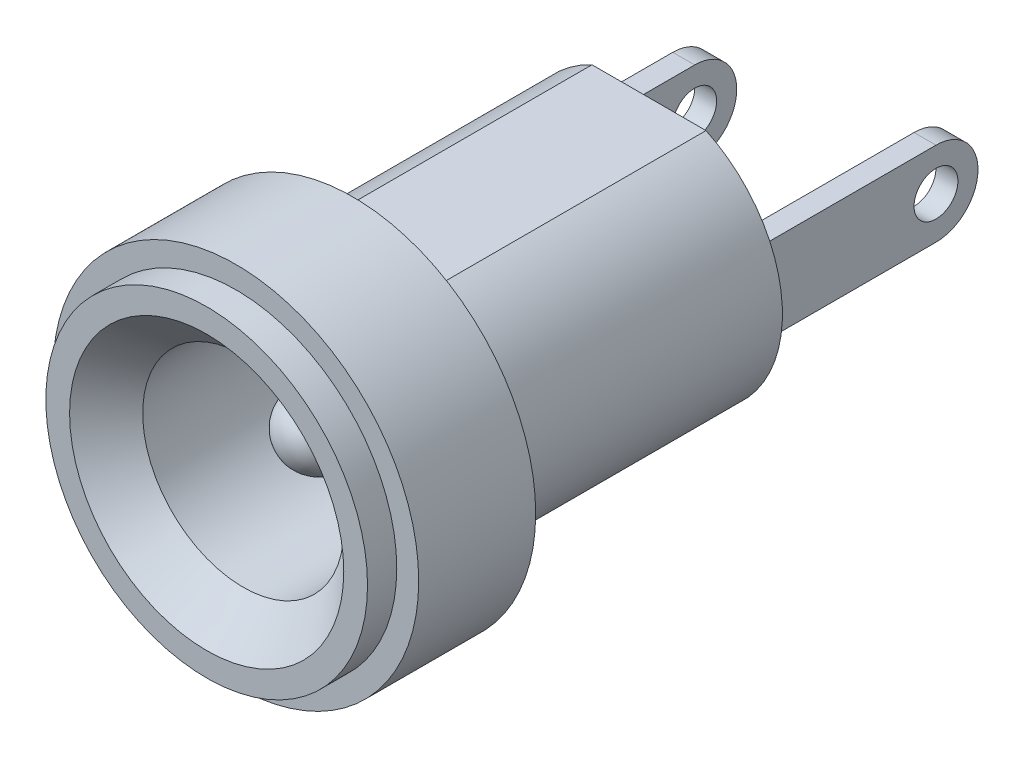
ISO-10303-21;
HEADER;
FILE_DESCRIPTION(('STEP AP214'),'2;1');
FILE_NAME('part.step','',(''),(''),'','','');
FILE_SCHEMA(('AUTOMOTIVE_DESIGN { 1 0 10303 214 1 1 1 1 }'));
ENDSEC;
DATA;
#1=APPLICATION_CONTEXT('core data for automotive mechanical design processes');
#2=APPLICATION_PROTOCOL_DEFINITION('international standard','automotive_design',2000,#1);
#3=PRODUCT_CONTEXT('',#1,'mechanical');
#4=PRODUCT('Part','Part','',(#3));
#5=PRODUCT_RELATED_PRODUCT_CATEGORY('part','',(#4));
#6=PRODUCT_DEFINITION_FORMATION('','',#4);
#7=PRODUCT_DEFINITION_CONTEXT('part definition',#1,'design');
#8=PRODUCT_DEFINITION('design','',#6,#7);
#9=PRODUCT_DEFINITION_SHAPE('','',#8);
#10=(LENGTH_UNIT() NAMED_UNIT(*) SI_UNIT(.MILLI.,.METRE.));
#11=(NAMED_UNIT(*) PLANE_ANGLE_UNIT() SI_UNIT($,.RADIAN.));
#12=(NAMED_UNIT(*) SI_UNIT($,.STERADIAN.) SOLID_ANGLE_UNIT());
#13=UNCERTAINTY_MEASURE_WITH_UNIT(LENGTH_MEASURE(1.E-05),#10,'distance_accuracy_value','');
#14=(GEOMETRIC_REPRESENTATION_CONTEXT(3) GLOBAL_UNCERTAINTY_ASSIGNED_CONTEXT((#13)) GLOBAL_UNIT_ASSIGNED_CONTEXT((#10,
#11,#12)) REPRESENTATION_CONTEXT('',''));
#15=CARTESIAN_POINT('',(0.,0.,0.));
#16=DIRECTION('',(0.,0.,1.));
#17=DIRECTION('',(1.,0.,0.));
#18=AXIS2_PLACEMENT_3D('',#15,#16,#17);
#19=CARTESIAN_POINT('',(0.,0.,-8.1));
#20=DIRECTION('',(0.,0.,1.));
#21=DIRECTION('',(1.,0.,0.));
#22=AXIS2_PLACEMENT_3D('',#19,#20,#21);
#23=PLANE('',#22);
#24=DIRECTION('',(1.,0.,0.));
#25=VECTOR('',#24,1.);
#26=CARTESIAN_POINT('',(2.3,1.15,-8.1));
#27=LINE('',#26,#25);
#28=CARTESIAN_POINT('',(2.3,1.15,-8.1));
#29=VERTEX_POINT('',#28);
#30=CARTESIAN_POINT('',(2.9,1.15,-8.1));
#31=VERTEX_POINT('',#30);
#32=EDGE_CURVE('E153',#29,#31,#27,.T.);
#33=ORIENTED_EDGE('',*,*,#32,.F.);
#34=DIRECTION('',(0.,-1.,0.));
#35=VECTOR('',#34,1.);
#36=CARTESIAN_POINT('',(2.3,1.15,-8.1));
#37=LINE('',#36,#35);
#38=CARTESIAN_POINT('',(2.3,-1.15,-8.1));
#39=VERTEX_POINT('',#38);
#40=EDGE_CURVE('E186',#29,#39,#37,.T.);
#41=ORIENTED_EDGE('',*,*,#40,.T.);
#42=DIRECTION('',(1.,0.,0.));
#43=VECTOR('',#42,1.);
#44=CARTESIAN_POINT('',(2.3,-1.15,-8.1));
#45=LINE('',#44,#43);
#46=CARTESIAN_POINT('',(2.9,-1.15,-8.1));
#47=VERTEX_POINT('',#46);
#48=EDGE_CURVE('E183',#39,#47,#45,.T.);
#49=ORIENTED_EDGE('',*,*,#48,.T.);
#50=DIRECTION('',(0.,-1.,0.));
#51=VECTOR('',#50,1.);
#52=CARTESIAN_POINT('',(2.9,1.15,-8.1));
#53=LINE('',#52,#51);
#54=EDGE_CURVE('E180',#31,#47,#53,.T.);
#55=ORIENTED_EDGE('',*,*,#54,.F.);
#56=EDGE_LOOP('',(#33,#41,#49,#55));
#57=FACE_BOUND('',#56,.T.);
#58=DIRECTION('',(1.,0.,0.));
#59=VECTOR('',#58,1.);
#60=CARTESIAN_POINT('',(-1.55964739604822,3.3,-8.1));
#61=LINE('',#60,#59);
#62=CARTESIAN_POINT('',(-1.55964739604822,3.3,-8.1));
#63=VERTEX_POINT('',#62);
#64=CARTESIAN_POINT('',(1.55964739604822,3.3,-8.1));
#65=VERTEX_POINT('',#64);
#66=EDGE_CURVE('E204',#63,#65,#61,.T.);
#67=ORIENTED_EDGE('',*,*,#66,.T.);
#68=CARTESIAN_POINT('',(0.,0.,-8.1));
#69=DIRECTION('',(0.,0.,1.));
#70=DIRECTION('',(1.,0.,0.));
#71=AXIS2_PLACEMENT_3D('',#68,#69,#70);
#72=CIRCLE('',#71,3.65);
#73=CARTESIAN_POINT('',(1.55964739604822,-3.3,-8.1));
#74=VERTEX_POINT('',#73);
#75=EDGE_CURVE('E206',#74,#65,#72,.T.);
#76=ORIENTED_EDGE('',*,*,#75,.F.);
#77=DIRECTION('',(-1.,0.,0.));
#78=VECTOR('',#77,1.);
#79=CARTESIAN_POINT('',(1.55964739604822,-3.3,-8.1));
#80=LINE('',#79,#78);
#81=CARTESIAN_POINT('',(-1.55964739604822,-3.3,-8.1));
#82=VERTEX_POINT('',#81);
#83=EDGE_CURVE('E210',#74,#82,#80,.T.);
#84=ORIENTED_EDGE('',*,*,#83,.T.);
#85=CARTESIAN_POINT('',(0.,0.,-8.1));
#86=DIRECTION('',(0.,0.,1.));
#87=DIRECTION('',(1.,0.,0.));
#88=AXIS2_PLACEMENT_3D('',#85,#86,#87);
#89=CIRCLE('',#88,3.65);
#90=EDGE_CURVE('E212',#63,#82,#89,.T.);
#91=ORIENTED_EDGE('',*,*,#90,.F.);
#92=EDGE_LOOP('',(#67,#76,#84,#91));
#93=FACE_BOUND('',#92,.T.);
#94=DIRECTION('',(0.,-1.,0.));
#95=VECTOR('',#94,1.);
#96=CARTESIAN_POINT('',(-2.3,1.15,-8.1));
#97=LINE('',#96,#95);
#98=CARTESIAN_POINT('',(-2.3,1.15,-8.1));
#99=VERTEX_POINT('',#98);
#100=CARTESIAN_POINT('',(-2.3,-1.15,-8.1));
#101=VERTEX_POINT('',#100);
#102=EDGE_CURVE('E157',#99,#101,#97,.T.);
#103=ORIENTED_EDGE('',*,*,#102,.F.);
#104=DIRECTION('',(-1.,0.,0.));
#105=VECTOR('',#104,1.);
#106=CARTESIAN_POINT('',(-2.3,1.15,-8.1));
#107=LINE('',#106,#105);
#108=CARTESIAN_POINT('',(-2.9,1.15,-8.1));
#109=VERTEX_POINT('',#108);
#110=EDGE_CURVE('E169',#99,#109,#107,.T.);
#111=ORIENTED_EDGE('',*,*,#110,.T.);
#112=DIRECTION('',(0.,-1.,0.));
#113=VECTOR('',#112,1.);
#114=CARTESIAN_POINT('',(-2.9,1.15,-8.1));
#115=LINE('',#114,#113);
#116=CARTESIAN_POINT('',(-2.9,-1.15,-8.1));
#117=VERTEX_POINT('',#116);
#118=EDGE_CURVE('E167',#109,#117,#115,.T.);
#119=ORIENTED_EDGE('',*,*,#118,.T.);
#120=DIRECTION('',(-1.,0.,0.));
#121=VECTOR('',#120,1.);
#122=CARTESIAN_POINT('',(-2.3,-1.15,-8.1));
#123=LINE('',#122,#121);
#124=EDGE_CURVE('E148',#101,#117,#123,.T.);
#125=ORIENTED_EDGE('',*,*,#124,.F.);
#126=EDGE_LOOP('',(#103,#111,#119,#125));
#127=FACE_BOUND('',#126,.T.);
#128=ADVANCED_FACE('F40',(#57,#93,#127),#23,.F.);
#129=CARTESIAN_POINT('',(0.,0.,0.));
#130=DIRECTION('',(0.,0.,1.));
#131=DIRECTION('',(1.,0.,0.));
#132=AXIS2_PLACEMENT_3D('',#129,#130,#131);
#133=PLANE('',#132);
#134=CARTESIAN_POINT('',(0.,0.,0.));
#135=DIRECTION('',(0.,0.,1.));
#136=DIRECTION('',(1.,0.,0.));
#137=AXIS2_PLACEMENT_3D('',#134,#135,#136);
#138=CIRCLE('',#137,5.);
#139=CARTESIAN_POINT('',(5.,0.,0.));
#140=VERTEX_POINT('',#139);
#141=EDGE_CURVE('E236',#140,#140,#138,.T.);
#142=ORIENTED_EDGE('',*,*,#141,.F.);
#143=EDGE_LOOP('',(#142));
#144=FACE_BOUND('',#143,.T.);
#145=DIRECTION('',(1.,0.,0.));
#146=VECTOR('',#145,1.);
#147=CARTESIAN_POINT('',(-1.55964739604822,3.3,0.));
#148=LINE('',#147,#146);
#149=CARTESIAN_POINT('',(-1.55964739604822,3.3,0.));
#150=VERTEX_POINT('',#149);
#151=CARTESIAN_POINT('',(1.55964739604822,3.3,0.));
#152=VERTEX_POINT('',#151);
#153=EDGE_CURVE('E203',#150,#152,#148,.T.);
#154=ORIENTED_EDGE('',*,*,#153,.F.);
#155=CARTESIAN_POINT('',(0.,0.,0.));
#156=DIRECTION('',(0.,0.,1.));
#157=DIRECTION('',(1.,0.,0.));
#158=AXIS2_PLACEMENT_3D('',#155,#156,#157);
#159=CIRCLE('',#158,3.65);
#160=CARTESIAN_POINT('',(-1.55964739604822,-3.3,0.));
#161=VERTEX_POINT('',#160);
#162=EDGE_CURVE('E207',#150,#161,#159,.T.);
#163=ORIENTED_EDGE('',*,*,#162,.T.);
#164=DIRECTION('',(-1.,0.,0.));
#165=VECTOR('',#164,1.);
#166=CARTESIAN_POINT('',(1.55964739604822,-3.3,0.));
#167=LINE('',#166,#165);
#168=CARTESIAN_POINT('',(1.55964739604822,-3.3,0.));
#169=VERTEX_POINT('',#168);
#170=EDGE_CURVE('E220',#169,#161,#167,.T.);
#171=ORIENTED_EDGE('',*,*,#170,.F.);
#172=CARTESIAN_POINT('',(0.,0.,0.));
#173=DIRECTION('',(0.,0.,1.));
#174=DIRECTION('',(1.,0.,0.));
#175=AXIS2_PLACEMENT_3D('',#172,#173,#174);
#176=CIRCLE('',#175,3.65);
#177=EDGE_CURVE('E217',#169,#152,#176,.T.);
#178=ORIENTED_EDGE('',*,*,#177,.T.);
#179=EDGE_LOOP('',(#154,#163,#171,#178));
#180=FACE_BOUND('',#179,.T.);
#181=ADVANCED_FACE('F319',(#144,#180),#133,.F.);
#182=CARTESIAN_POINT('',(0.,0.,3.2));
#183=DIRECTION('',(0.,0.,-1.));
#184=DIRECTION('',(-1.,0.,0.));
#185=AXIS2_PLACEMENT_3D('',#182,#183,#184);
#186=CYLINDRICAL_SURFACE('',#185,5.);
#187=CARTESIAN_POINT('',(0.,0.,3.2));
#188=DIRECTION('',(0.,0.,1.));
#189=DIRECTION('',(1.,0.,0.));
#190=AXIS2_PLACEMENT_3D('',#187,#188,#189);
#191=CIRCLE('',#190,5.);
#192=CARTESIAN_POINT('',(5.,0.,3.2));
#193=VERTEX_POINT('',#192);
#194=EDGE_CURVE('E241',#193,#193,#191,.T.);
#195=ORIENTED_EDGE('',*,*,#194,.F.);
#196=EDGE_LOOP('',(#195));
#197=FACE_BOUND('',#196,.T.);
#198=ORIENTED_EDGE('',*,*,#141,.T.);
#199=EDGE_LOOP('',(#198));
#200=FACE_BOUND('',#199,.T.);
#201=ADVANCED_FACE('F325',(#197,#200),#186,.T.);
#202=CARTESIAN_POINT('',(0.,0.,3.2));
#203=DIRECTION('',(0.,0.,1.));
#204=DIRECTION('',(1.,0.,0.));
#205=AXIS2_PLACEMENT_3D('',#202,#203,#204);
#206=PLANE('',#205);
#207=CARTESIAN_POINT('',(0.,0.,3.2));
#208=DIRECTION('',(0.,0.,1.));
#209=DIRECTION('',(1.,0.,0.));
#210=AXIS2_PLACEMENT_3D('',#207,#208,#209);
#211=CIRCLE('',#210,4.4);
#212=CARTESIAN_POINT('',(4.4,0.,3.2));
#213=VERTEX_POINT('',#212);
#214=EDGE_CURVE('E237',#213,#213,#211,.T.);
#215=ORIENTED_EDGE('',*,*,#214,.F.);
#216=EDGE_LOOP('',(#215));
#217=FACE_BOUND('',#216,.T.);
#218=ORIENTED_EDGE('',*,*,#194,.T.);
#219=EDGE_LOOP('',(#218));
#220=FACE_BOUND('',#219,.T.);
#221=ADVANCED_FACE('F357',(#217,#220),#206,.T.);
#222=CARTESIAN_POINT('',(0.,0.,4.));
#223=DIRECTION('',(0.,0.,-1.));
#224=DIRECTION('',(-1.,0.,0.));
#225=AXIS2_PLACEMENT_3D('',#222,#223,#224);
#226=CYLINDRICAL_SURFACE('',#225,4.4);
#227=CARTESIAN_POINT('',(0.,0.,4.));
#228=DIRECTION('',(0.,0.,1.));
#229=DIRECTION('',(1.,0.,0.));
#230=AXIS2_PLACEMENT_3D('',#227,#228,#229);
#231=CIRCLE('',#230,4.4);
#232=CARTESIAN_POINT('',(4.4,0.,4.));
#233=VERTEX_POINT('',#232);
#234=EDGE_CURVE('E233',#233,#233,#231,.T.);
#235=ORIENTED_EDGE('',*,*,#234,.F.);
#236=EDGE_LOOP('',(#235));
#237=FACE_BOUND('',#236,.T.);
#238=ORIENTED_EDGE('',*,*,#214,.T.);
#239=EDGE_LOOP('',(#238));
#240=FACE_BOUND('',#239,.T.);
#241=ADVANCED_FACE('F353',(#237,#240),#226,.T.);
#242=CARTESIAN_POINT('',(0.,0.,4.));
#243=DIRECTION('',(0.,0.,1.));
#244=DIRECTION('',(1.,0.,0.));
#245=AXIS2_PLACEMENT_3D('',#242,#243,#244);
#246=PLANE('',#245);
#247=CARTESIAN_POINT('',(0.,0.,4.));
#248=DIRECTION('',(0.,0.,1.));
#249=DIRECTION('',(1.,0.,0.));
#250=AXIS2_PLACEMENT_3D('',#247,#248,#249);
#251=CIRCLE('',#250,3.75);
#252=CARTESIAN_POINT('',(3.75,0.,4.));
#253=VERTEX_POINT('',#252);
#254=EDGE_CURVE('E248',#253,#253,#251,.F.);
#255=ORIENTED_EDGE('',*,*,#254,.T.);
#256=EDGE_LOOP('',(#255));
#257=FACE_BOUND('',#256,.T.);
#258=ORIENTED_EDGE('',*,*,#234,.T.);
#259=EDGE_LOOP('',(#258));
#260=FACE_BOUND('',#259,.T.);
#261=ADVANCED_FACE('F349',(#257,#260),#246,.T.);
#262=CARTESIAN_POINT('',(-1.55964739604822,3.3,-8.1));
#263=DIRECTION('',(0.,-1.,0.));
#264=DIRECTION('',(0.,0.,-1.));
#265=AXIS2_PLACEMENT_3D('',#262,#263,#264);
#266=PLANE('',#265);
#267=ORIENTED_EDGE('',*,*,#153,.T.);
#268=DIRECTION('',(0.,0.,1.));
#269=VECTOR('',#268,1.);
#270=CARTESIAN_POINT('',(1.55964739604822,3.3,-8.1));
#271=LINE('',#270,#269);
#272=EDGE_CURVE('E230',#65,#152,#271,.T.);
#273=ORIENTED_EDGE('',*,*,#272,.F.);
#274=ORIENTED_EDGE('',*,*,#66,.F.);
#275=DIRECTION('',(0.,0.,1.));
#276=VECTOR('',#275,1.);
#277=CARTESIAN_POINT('',(-1.55964739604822,3.3,-8.1));
#278=LINE('',#277,#276);
#279=EDGE_CURVE('E215',#63,#150,#278,.T.);
#280=ORIENTED_EDGE('',*,*,#279,.T.);
#281=EDGE_LOOP('',(#267,#273,#274,#280));
#282=FACE_BOUND('',#281,.T.);
#283=ADVANCED_FACE('F345',(#282),#266,.F.);
#284=CARTESIAN_POINT('',(0.,0.,-8.1));
#285=DIRECTION('',(0.,0.,1.));
#286=DIRECTION('',(1.,0.,0.));
#287=AXIS2_PLACEMENT_3D('',#284,#285,#286);
#288=CYLINDRICAL_SURFACE('',#287,3.65);
#289=ORIENTED_EDGE('',*,*,#177,.F.);
#290=DIRECTION('',(0.,0.,1.));
#291=VECTOR('',#290,1.);
#292=CARTESIAN_POINT('',(1.55964739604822,-3.3,-8.1));
#293=LINE('',#292,#291);
#294=EDGE_CURVE('E228',#74,#169,#293,.T.);
#295=ORIENTED_EDGE('',*,*,#294,.F.);
#296=ORIENTED_EDGE('',*,*,#75,.T.);
#297=ORIENTED_EDGE('',*,*,#272,.T.);
#298=EDGE_LOOP('',(#289,#295,#296,#297));
#299=FACE_BOUND('',#298,.T.);
#300=ADVANCED_FACE('F341',(#299),#288,.T.);
#301=CARTESIAN_POINT('',(1.55964739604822,-3.3,-8.1));
#302=DIRECTION('',(0.,1.,0.));
#303=DIRECTION('',(0.,0.,1.));
#304=AXIS2_PLACEMENT_3D('',#301,#302,#303);
#305=PLANE('',#304);
#306=ORIENTED_EDGE('',*,*,#170,.T.);
#307=DIRECTION('',(0.,0.,1.));
#308=VECTOR('',#307,1.);
#309=CARTESIAN_POINT('',(-1.55964739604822,-3.3,-8.1));
#310=LINE('',#309,#308);
#311=EDGE_CURVE('E226',#82,#161,#310,.T.);
#312=ORIENTED_EDGE('',*,*,#311,.F.);
#313=ORIENTED_EDGE('',*,*,#83,.F.);
#314=ORIENTED_EDGE('',*,*,#294,.T.);
#315=EDGE_LOOP('',(#306,#312,#313,#314));
#316=FACE_BOUND('',#315,.T.);
#317=ADVANCED_FACE('F337',(#316),#305,.F.);
#318=CARTESIAN_POINT('',(0.,0.,-8.1));
#319=DIRECTION('',(0.,0.,1.));
#320=DIRECTION('',(1.,0.,0.));
#321=AXIS2_PLACEMENT_3D('',#318,#319,#320);
#322=CYLINDRICAL_SURFACE('',#321,3.65);
#323=ORIENTED_EDGE('',*,*,#162,.F.);
#324=ORIENTED_EDGE('',*,*,#279,.F.);
#325=ORIENTED_EDGE('',*,*,#90,.T.);
#326=ORIENTED_EDGE('',*,*,#311,.T.);
#327=EDGE_LOOP('',(#323,#324,#325,#326));
#328=FACE_BOUND('',#327,.T.);
#329=ADVANCED_FACE('F334',(#328),#322,.T.);
#330=CARTESIAN_POINT('',(0.,0.,-5.));
#331=DIRECTION('',(0.,0.,1.));
#332=DIRECTION('',(1.,0.,0.));
#333=AXIS2_PLACEMENT_3D('',#330,#331,#332);
#334=CYLINDRICAL_SURFACE('',#333,2.75);
#335=CARTESIAN_POINT('',(0.,0.,3.));
#336=DIRECTION('',(0.,0.,1.));
#337=DIRECTION('',(1.,0.,0.));
#338=AXIS2_PLACEMENT_3D('',#335,#336,#337);
#339=CIRCLE('',#338,2.75);
#340=CARTESIAN_POINT('',(2.75,0.,3.));
#341=VERTEX_POINT('',#340);
#342=EDGE_CURVE('E240',#341,#341,#339,.T.);
#343=ORIENTED_EDGE('',*,*,#342,.T.);
#344=EDGE_LOOP('',(#343));
#345=FACE_BOUND('',#344,.T.);
#346=CARTESIAN_POINT('',(0.,0.,-5.));
#347=DIRECTION('',(0.,0.,1.));
#348=DIRECTION('',(1.,0.,0.));
#349=AXIS2_PLACEMENT_3D('',#346,#347,#348);
#350=CIRCLE('',#349,2.75);
#351=CARTESIAN_POINT('',(2.75,0.,-5.));
#352=VERTEX_POINT('',#351);
#353=EDGE_CURVE('E200',#352,#352,#350,.T.);
#354=ORIENTED_EDGE('',*,*,#353,.F.);
#355=EDGE_LOOP('',(#354));
#356=FACE_BOUND('',#355,.T.);
#357=ADVANCED_FACE('F332',(#345,#356),#334,.F.);
#358=CARTESIAN_POINT('',(0.,0.,-5.));
#359=DIRECTION('',(0.,0.,1.));
#360=DIRECTION('',(1.,0.,0.));
#361=AXIS2_PLACEMENT_3D('',#358,#359,#360);
#362=PLANE('',#361);
#363=CARTESIAN_POINT('',(0.,0.,-5.));
#364=DIRECTION('',(0.,0.,1.));
#365=DIRECTION('',(1.,0.,0.));
#366=AXIS2_PLACEMENT_3D('',#363,#364,#365);
#367=CIRCLE('',#366,0.95);
#368=CARTESIAN_POINT('',(0.95,0.,-5.));
#369=VERTEX_POINT('',#368);
#370=EDGE_CURVE('E197',#369,#369,#367,.T.);
#371=ORIENTED_EDGE('',*,*,#370,.F.);
#372=EDGE_LOOP('',(#371));
#373=FACE_BOUND('',#372,.T.);
#374=ORIENTED_EDGE('',*,*,#353,.T.);
#375=EDGE_LOOP('',(#374));
#376=FACE_BOUND('',#375,.T.);
#377=ADVANCED_FACE('F410',(#373,#376),#362,.T.);
#378=CARTESIAN_POINT('',(0.,0.,6.68700576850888));
#379=DIRECTION('',(0.,0.,-1.));
#380=DIRECTION('',(-1.,0.,0.));
#381=AXIS2_PLACEMENT_3D('',#378,#379,#380);
#382=CYLINDRICAL_SURFACE('',#381,0.95);
#383=CARTESIAN_POINT('',(0.,0.,0.95));
#384=DIRECTION('',(0.,0.,-1.));
#385=DIRECTION('',(-1.,0.,0.));
#386=AXIS2_PLACEMENT_3D('',#383,#384,#385);
#387=CIRCLE('',#386,0.95);
#388=CARTESIAN_POINT('',(-0.95,0.,0.95));
#389=VERTEX_POINT('',#388);
#390=EDGE_CURVE('E251',#389,#389,#387,.T.);
#391=ORIENTED_EDGE('',*,*,#390,.T.);
#392=EDGE_LOOP('',(#391));
#393=FACE_BOUND('',#392,.T.);
#394=ORIENTED_EDGE('',*,*,#370,.T.);
#395=EDGE_LOOP('',(#394));
#396=FACE_BOUND('',#395,.T.);
#397=ADVANCED_FACE('F372',(#393,#396),#382,.T.);
#398=CARTESIAN_POINT('',(0.,0.,3.));
#399=DIRECTION('',(0.,0.,1.));
#400=DIRECTION('',(1.,0.,0.));
#401=AXIS2_PLACEMENT_3D('',#398,#399,#400);
#402=CONICAL_SURFACE('',#401,2.75,0.78539816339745);
#403=ORIENTED_EDGE('',*,*,#254,.F.);
#404=EDGE_LOOP('',(#403));
#405=FACE_BOUND('',#404,.T.);
#406=ORIENTED_EDGE('',*,*,#342,.F.);
#407=EDGE_LOOP('',(#406));
#408=FACE_BOUND('',#407,.T.);
#409=ADVANCED_FACE('F366',(#405,#408),#402,.F.);
#410=CARTESIAN_POINT('',(0.,0.,0.95));
#411=DIRECTION('',(0.,0.,1.));
#412=DIRECTION('',(1.,0.,0.));
#413=AXIS2_PLACEMENT_3D('',#410,#411,#412);
#414=SPHERICAL_SURFACE('',#413,0.95);
#415=ORIENTED_EDGE('',*,*,#390,.F.);
#416=EDGE_LOOP('',(#415));
#417=FACE_BOUND('',#416,.T.);
#418=ADVANCED_FACE('F371',(#417),#414,.T.);
#419=CARTESIAN_POINT('',(2.3,1.15,-14.2));
#420=DIRECTION('',(0.,-1.,0.));
#421=DIRECTION('',(0.,0.,-1.));
#422=AXIS2_PLACEMENT_3D('',#419,#420,#421);
#423=PLANE('',#422);
#424=DIRECTION('',(0.,0.,1.));
#425=VECTOR('',#424,1.);
#426=CARTESIAN_POINT('',(2.9,1.15,-14.2));
#427=LINE('',#426,#425);
#428=CARTESIAN_POINT('',(2.9,1.15,-13.05));
#429=VERTEX_POINT('',#428);
#430=EDGE_CURVE('E195',#429,#31,#427,.T.);
#431=ORIENTED_EDGE('',*,*,#430,.F.);
#432=DIRECTION('',(1.,0.,0.));
#433=VECTOR('',#432,1.);
#434=CARTESIAN_POINT('',(2.3,1.15,-13.05));
#435=LINE('',#434,#433);
#436=CARTESIAN_POINT('',(2.3,1.15,-13.05));
#437=VERTEX_POINT('',#436);
#438=EDGE_CURVE('E12',#429,#437,#435,.F.);
#439=ORIENTED_EDGE('',*,*,#438,.T.);
#440=DIRECTION('',(0.,0.,1.));
#441=VECTOR('',#440,1.);
#442=CARTESIAN_POINT('',(2.3,1.15,-14.2));
#443=LINE('',#442,#441);
#444=EDGE_CURVE('E189',#437,#29,#443,.T.);
#445=ORIENTED_EDGE('',*,*,#444,.T.);
#446=ORIENTED_EDGE('',*,*,#32,.T.);
#447=EDGE_LOOP('',(#431,#439,#445,#446));
#448=FACE_BOUND('',#447,.T.);
#449=ADVANCED_FACE('F376',(#448),#423,.F.);
#450=CARTESIAN_POINT('',(2.9,1.15,-14.2));
#451=DIRECTION('',(-1.,0.,0.));
#452=DIRECTION('',(0.,-1.,0.));
#453=AXIS2_PLACEMENT_3D('',#450,#451,#452);
#454=PLANE('',#453);
#455=CARTESIAN_POINT('',(2.9,0.,-13.05));
#456=DIRECTION('',(-1.,0.,0.));
#457=DIRECTION('',(0.,-1.,0.));
#458=AXIS2_PLACEMENT_3D('',#455,#456,#457);
#459=CIRCLE('',#458,0.6);
#460=CARTESIAN_POINT('',(2.9,-0.6,-13.05));
#461=VERTEX_POINT('',#460);
#462=EDGE_CURVE('E278',#461,#461,#459,.F.);
#463=ORIENTED_EDGE('',*,*,#462,.F.);
#464=EDGE_LOOP('',(#463));
#465=FACE_BOUND('',#464,.T.);
#466=DIRECTION('',(0.,0.,1.));
#467=VECTOR('',#466,1.);
#468=CARTESIAN_POINT('',(2.9,-1.15,-14.2));
#469=LINE('',#468,#467);
#470=CARTESIAN_POINT('',(2.9,-1.15,-13.05));
#471=VERTEX_POINT('',#470);
#472=EDGE_CURVE('E193',#471,#47,#469,.T.);
#473=ORIENTED_EDGE('',*,*,#472,.F.);
#474=CARTESIAN_POINT('',(2.9,0.,-13.05));
#475=DIRECTION('',(-1.,0.,0.));
#476=DIRECTION('',(0.,-1.,0.));
#477=AXIS2_PLACEMENT_3D('',#474,#475,#476);
#478=CIRCLE('',#477,1.15);
#479=CARTESIAN_POINT('',(2.9,0.,-14.2));
#480=VERTEX_POINT('',#479);
#481=EDGE_CURVE('E270',#471,#480,#478,.F.);
#482=ORIENTED_EDGE('',*,*,#481,.T.);
#483=CARTESIAN_POINT('',(2.9,0.,-13.05));
#484=DIRECTION('',(-1.,0.,0.));
#485=DIRECTION('',(0.,-1.,0.));
#486=AXIS2_PLACEMENT_3D('',#483,#484,#485);
#487=CIRCLE('',#486,1.15);
#488=EDGE_CURVE('E268',#480,#429,#487,.F.);
#489=ORIENTED_EDGE('',*,*,#488,.T.);
#490=ORIENTED_EDGE('',*,*,#430,.T.);
#491=ORIENTED_EDGE('',*,*,#54,.T.);
#492=EDGE_LOOP('',(#473,#482,#489,#490,#491));
#493=FACE_BOUND('',#492,.T.);
#494=ADVANCED_FACE('F399',(#465,#493),#454,.F.);
#495=CARTESIAN_POINT('',(2.3,-1.15,-14.2));
#496=DIRECTION('',(0.,-1.,0.));
#497=DIRECTION('',(0.,0.,-1.));
#498=AXIS2_PLACEMENT_3D('',#495,#496,#497);
#499=PLANE('',#498);
#500=DIRECTION('',(0.,0.,1.));
#501=VECTOR('',#500,1.);
#502=CARTESIAN_POINT('',(2.3,-1.15,-14.2));
#503=LINE('',#502,#501);
#504=CARTESIAN_POINT('',(2.3,-1.15,-13.05));
#505=VERTEX_POINT('',#504);
#506=EDGE_CURVE('E191',#505,#39,#503,.T.);
#507=ORIENTED_EDGE('',*,*,#506,.F.);
#508=DIRECTION('',(1.,0.,0.));
#509=VECTOR('',#508,1.);
#510=CARTESIAN_POINT('',(2.3,-1.15,-13.05));
#511=LINE('',#510,#509);
#512=EDGE_CURVE('E265',#505,#471,#511,.T.);
#513=ORIENTED_EDGE('',*,*,#512,.T.);
#514=ORIENTED_EDGE('',*,*,#472,.T.);
#515=ORIENTED_EDGE('',*,*,#48,.F.);
#516=EDGE_LOOP('',(#507,#513,#514,#515));
#517=FACE_BOUND('',#516,.T.);
#518=ADVANCED_FACE('F394',(#517),#499,.T.);
#519=CARTESIAN_POINT('',(2.3,1.15,-14.2));
#520=DIRECTION('',(-1.,0.,0.));
#521=DIRECTION('',(0.,0.,1.));
#522=AXIS2_PLACEMENT_3D('',#519,#520,#521);
#523=PLANE('',#522);
#524=CARTESIAN_POINT('',(2.3,0.,-13.05));
#525=DIRECTION('',(-1.,0.,0.));
#526=DIRECTION('',(0.,0.,1.));
#527=AXIS2_PLACEMENT_3D('',#524,#525,#526);
#528=CIRCLE('',#527,0.6);
#529=CARTESIAN_POINT('',(2.3,0.,-12.45));
#530=VERTEX_POINT('',#529);
#531=EDGE_CURVE('E282',#530,#530,#528,.T.);
#532=ORIENTED_EDGE('',*,*,#531,.F.);
#533=EDGE_LOOP('',(#532));
#534=FACE_BOUND('',#533,.T.);
#535=CARTESIAN_POINT('',(2.3,0.,-13.05));
#536=DIRECTION('',(-1.,0.,0.));
#537=DIRECTION('',(0.,0.,1.));
#538=AXIS2_PLACEMENT_3D('',#535,#536,#537);
#539=CIRCLE('',#538,1.15);
#540=CARTESIAN_POINT('',(2.3,0.,-14.2));
#541=VERTEX_POINT('',#540);
#542=EDGE_CURVE('E57',#437,#541,#539,.T.);
#543=ORIENTED_EDGE('',*,*,#542,.T.);
#544=CARTESIAN_POINT('',(2.3,0.,-13.05));
#545=DIRECTION('',(-1.,0.,0.));
#546=DIRECTION('',(0.,0.,1.));
#547=AXIS2_PLACEMENT_3D('',#544,#545,#546);
#548=CIRCLE('',#547,1.15);
#549=EDGE_CURVE('E49',#541,#505,#548,.T.);
#550=ORIENTED_EDGE('',*,*,#549,.T.);
#551=ORIENTED_EDGE('',*,*,#506,.T.);
#552=ORIENTED_EDGE('',*,*,#40,.F.);
#553=ORIENTED_EDGE('',*,*,#444,.F.);
#554=EDGE_LOOP('',(#543,#550,#551,#552,#553));
#555=FACE_BOUND('',#554,.T.);
#556=ADVANCED_FACE('F390',(#534,#555),#523,.T.);
#557=CARTESIAN_POINT('',(-2.3,1.15,-12.8));
#558=DIRECTION('',(-1.,0.,0.));
#559=DIRECTION('',(0.,0.,1.));
#560=AXIS2_PLACEMENT_3D('',#557,#558,#559);
#561=PLANE('',#560);
#562=CARTESIAN_POINT('',(-2.3,0.,-11.65));
#563=DIRECTION('',(-1.,0.,0.));
#564=DIRECTION('',(0.,0.,1.));
#565=AXIS2_PLACEMENT_3D('',#562,#563,#564);
#566=CIRCLE('',#565,0.6);
#567=CARTESIAN_POINT('',(-2.3,0.,-11.05));
#568=VERTEX_POINT('',#567);
#569=EDGE_CURVE('E286',#568,#568,#566,.F.);
#570=ORIENTED_EDGE('',*,*,#569,.F.);
#571=EDGE_LOOP('',(#570));
#572=FACE_BOUND('',#571,.T.);
#573=DIRECTION('',(0.,0.,1.));
#574=VECTOR('',#573,1.);
#575=CARTESIAN_POINT('',(-2.3,-1.15,-12.8));
#576=LINE('',#575,#574);
#577=CARTESIAN_POINT('',(-2.3,-1.15,-11.65));
#578=VERTEX_POINT('',#577);
#579=EDGE_CURVE('E143',#578,#101,#576,.T.);
#580=ORIENTED_EDGE('',*,*,#579,.F.);
#581=CARTESIAN_POINT('',(-2.3,0.,-11.65));
#582=DIRECTION('',(-1.,0.,0.));
#583=DIRECTION('',(0.,0.,1.));
#584=AXIS2_PLACEMENT_3D('',#581,#582,#583);
#585=CIRCLE('',#584,1.15);
#586=CARTESIAN_POINT('',(-2.3,0.,-12.8));
#587=VERTEX_POINT('',#586);
#588=EDGE_CURVE('E261',#578,#587,#585,.F.);
#589=ORIENTED_EDGE('',*,*,#588,.T.);
#590=CARTESIAN_POINT('',(-2.3,0.,-11.65));
#591=DIRECTION('',(-1.,0.,0.));
#592=DIRECTION('',(0.,0.,1.));
#593=AXIS2_PLACEMENT_3D('',#590,#591,#592);
#594=CIRCLE('',#593,1.15);
#595=CARTESIAN_POINT('',(-2.3,1.15,-11.65));
#596=VERTEX_POINT('',#595);
#597=EDGE_CURVE('E259',#587,#596,#594,.F.);
#598=ORIENTED_EDGE('',*,*,#597,.T.);
#599=DIRECTION('',(0.,0.,1.));
#600=VECTOR('',#599,1.);
#601=CARTESIAN_POINT('',(-2.3,1.15,-12.8));
#602=LINE('',#601,#600);
#603=EDGE_CURVE('E160',#596,#99,#602,.T.);
#604=ORIENTED_EDGE('',*,*,#603,.T.);
#605=ORIENTED_EDGE('',*,*,#102,.T.);
#606=EDGE_LOOP('',(#580,#589,#598,#604,#605));
#607=FACE_BOUND('',#606,.T.);
#608=ADVANCED_FACE('F158',(#572,#607),#561,.F.);
#609=CARTESIAN_POINT('',(-2.3,-1.15,-12.8));
#610=DIRECTION('',(0.,1.,0.));
#611=DIRECTION('',(0.,0.,1.));
#612=AXIS2_PLACEMENT_3D('',#609,#610,#611);
#613=PLANE('',#612);
#614=DIRECTION('',(0.,0.,1.));
#615=VECTOR('',#614,1.);
#616=CARTESIAN_POINT('',(-2.9,-1.15,-12.8));
#617=LINE('',#616,#615);
#618=CARTESIAN_POINT('',(-2.9,-1.15,-11.65));
#619=VERTEX_POINT('',#618);
#620=EDGE_CURVE('E154',#619,#117,#617,.T.);
#621=ORIENTED_EDGE('',*,*,#620,.F.);
#622=DIRECTION('',(-1.,0.,0.));
#623=VECTOR('',#622,1.);
#624=CARTESIAN_POINT('',(-2.3,-1.15,-11.65));
#625=LINE('',#624,#623);
#626=EDGE_CURVE('E151',#619,#578,#625,.F.);
#627=ORIENTED_EDGE('',*,*,#626,.T.);
#628=ORIENTED_EDGE('',*,*,#579,.T.);
#629=ORIENTED_EDGE('',*,*,#124,.T.);
#630=EDGE_LOOP('',(#621,#627,#628,#629));
#631=FACE_BOUND('',#630,.T.);
#632=ADVANCED_FACE('F146',(#631),#613,.F.);
#633=CARTESIAN_POINT('',(-2.9,1.15,-12.8));
#634=DIRECTION('',(-1.,0.,0.));
#635=DIRECTION('',(0.,-1.,0.));
#636=AXIS2_PLACEMENT_3D('',#633,#634,#635);
#637=PLANE('',#636);
#638=CARTESIAN_POINT('',(-2.9,0.,-11.65));
#639=DIRECTION('',(-1.,0.,0.));
#640=DIRECTION('',(0.,-1.,0.));
#641=AXIS2_PLACEMENT_3D('',#638,#639,#640);
#642=CIRCLE('',#641,0.6);
#643=CARTESIAN_POINT('',(-2.9,-0.6,-11.65));
#644=VERTEX_POINT('',#643);
#645=EDGE_CURVE('E291',#644,#644,#642,.T.);
#646=ORIENTED_EDGE('',*,*,#645,.F.);
#647=EDGE_LOOP('',(#646));
#648=FACE_BOUND('',#647,.T.);
#649=CARTESIAN_POINT('',(-2.9,0.,-11.65));
#650=DIRECTION('',(-1.,0.,0.));
#651=DIRECTION('',(0.,-1.,0.));
#652=AXIS2_PLACEMENT_3D('',#649,#650,#651);
#653=CIRCLE('',#652,1.15);
#654=CARTESIAN_POINT('',(-2.9,1.15,-11.65));
#655=VERTEX_POINT('',#654);
#656=CARTESIAN_POINT('',(-2.9,0.,-12.8));
#657=VERTEX_POINT('',#656);
#658=EDGE_CURVE('E254',#655,#657,#653,.T.);
#659=ORIENTED_EDGE('',*,*,#658,.T.);
#660=CARTESIAN_POINT('',(-2.9,0.,-11.65));
#661=DIRECTION('',(-1.,0.,0.));
#662=DIRECTION('',(0.,-1.,0.));
#663=AXIS2_PLACEMENT_3D('',#660,#661,#662);
#664=CIRCLE('',#663,1.15);
#665=EDGE_CURVE('E256',#657,#619,#664,.T.);
#666=ORIENTED_EDGE('',*,*,#665,.T.);
#667=ORIENTED_EDGE('',*,*,#620,.T.);
#668=ORIENTED_EDGE('',*,*,#118,.F.);
#669=DIRECTION('',(0.,0.,1.));
#670=VECTOR('',#669,1.);
#671=CARTESIAN_POINT('',(-2.9,1.15,-12.8));
#672=LINE('',#671,#670);
#673=EDGE_CURVE('E175',#655,#109,#672,.T.);
#674=ORIENTED_EDGE('',*,*,#673,.F.);
#675=EDGE_LOOP('',(#659,#666,#667,#668,#674));
#676=FACE_BOUND('',#675,.T.);
#677=ADVANCED_FACE('F298',(#648,#676),#637,.T.);
#678=CARTESIAN_POINT('',(-2.3,1.15,-12.8));
#679=DIRECTION('',(0.,1.,0.));
#680=DIRECTION('',(0.,0.,1.));
#681=AXIS2_PLACEMENT_3D('',#678,#679,#680);
#682=PLANE('',#681);
#683=ORIENTED_EDGE('',*,*,#603,.F.);
#684=DIRECTION('',(-1.,0.,0.));
#685=VECTOR('',#684,1.);
#686=CARTESIAN_POINT('',(-2.3,1.15,-11.65));
#687=LINE('',#686,#685);
#688=EDGE_CURVE('E263',#596,#655,#687,.T.);
#689=ORIENTED_EDGE('',*,*,#688,.T.);
#690=ORIENTED_EDGE('',*,*,#673,.T.);
#691=ORIENTED_EDGE('',*,*,#110,.F.);
#692=EDGE_LOOP('',(#683,#689,#690,#691));
#693=FACE_BOUND('',#692,.T.);
#694=ADVANCED_FACE('F301',(#693),#682,.T.);
#695=CARTESIAN_POINT('',(-2.3,0.,-11.65));
#696=DIRECTION('',(-1.,0.,0.));
#697=DIRECTION('',(0.,0.,1.));
#698=AXIS2_PLACEMENT_3D('',#695,#696,#697);
#699=CYLINDRICAL_SURFACE('',#698,1.15);
#700=ORIENTED_EDGE('',*,*,#688,.F.);
#701=ORIENTED_EDGE('',*,*,#597,.F.);
#702=DIRECTION('',(-1.,0.,0.));
#703=VECTOR('',#702,1.);
#704=CARTESIAN_POINT('',(0.,0.,-12.8));
#705=LINE('',#704,#703);
#706=EDGE_CURVE('E164',#657,#587,#705,.F.);
#707=ORIENTED_EDGE('',*,*,#706,.F.);
#708=ORIENTED_EDGE('',*,*,#658,.F.);
#709=EDGE_LOOP('',(#700,#701,#707,#708));
#710=FACE_BOUND('',#709,.T.);
#711=ADVANCED_FACE('F308',(#710),#699,.T.);
#712=CARTESIAN_POINT('',(0.,0.,-11.65));
#713=DIRECTION('',(1.,0.,0.));
#714=DIRECTION('',(0.,0.,-1.));
#715=AXIS2_PLACEMENT_3D('',#712,#713,#714);
#716=CYLINDRICAL_SURFACE('',#715,1.15);
#717=ORIENTED_EDGE('',*,*,#588,.F.);
#718=ORIENTED_EDGE('',*,*,#626,.F.);
#719=ORIENTED_EDGE('',*,*,#665,.F.);
#720=ORIENTED_EDGE('',*,*,#706,.T.);
#721=EDGE_LOOP('',(#717,#718,#719,#720));
#722=FACE_BOUND('',#721,.T.);
#723=ADVANCED_FACE('F309',(#722),#716,.T.);
#724=CARTESIAN_POINT('',(0.,0.,-13.05));
#725=DIRECTION('',(-1.,0.,0.));
#726=DIRECTION('',(0.,0.,1.));
#727=AXIS2_PLACEMENT_3D('',#724,#725,#726);
#728=CYLINDRICAL_SURFACE('',#727,1.15);
#729=DIRECTION('',(1.,0.,0.));
#730=VECTOR('',#729,1.);
#731=CARTESIAN_POINT('',(2.9,0.,-14.2));
#732=LINE('',#731,#730);
#733=EDGE_CURVE('E44',#541,#480,#732,.T.);
#734=ORIENTED_EDGE('',*,*,#733,.F.);
#735=ORIENTED_EDGE('',*,*,#542,.F.);
#736=ORIENTED_EDGE('',*,*,#438,.F.);
#737=ORIENTED_EDGE('',*,*,#488,.F.);
#738=EDGE_LOOP('',(#734,#735,#736,#737));
#739=FACE_BOUND('',#738,.T.);
#740=ADVANCED_FACE('F42',(#739),#728,.T.);
#741=CARTESIAN_POINT('',(2.3,0.,-13.05));
#742=DIRECTION('',(1.,0.,0.));
#743=DIRECTION('',(0.,0.,-1.));
#744=AXIS2_PLACEMENT_3D('',#741,#742,#743);
#745=CYLINDRICAL_SURFACE('',#744,1.15);
#746=ORIENTED_EDGE('',*,*,#549,.F.);
#747=ORIENTED_EDGE('',*,*,#733,.T.);
#748=ORIENTED_EDGE('',*,*,#481,.F.);
#749=ORIENTED_EDGE('',*,*,#512,.F.);
#750=EDGE_LOOP('',(#746,#747,#748,#749));
#751=FACE_BOUND('',#750,.T.);
#752=ADVANCED_FACE('F379',(#751),#745,.T.);
#753=CARTESIAN_POINT('',(5.001,0.,-13.05));
#754=DIRECTION('',(-1.,0.,0.));
#755=DIRECTION('',(0.,0.,1.));
#756=AXIS2_PLACEMENT_3D('',#753,#754,#755);
#757=CYLINDRICAL_SURFACE('',#756,0.6);
#758=ORIENTED_EDGE('',*,*,#531,.T.);
#759=EDGE_LOOP('',(#758));
#760=FACE_BOUND('',#759,.T.);
#761=ORIENTED_EDGE('',*,*,#462,.T.);
#762=EDGE_LOOP('',(#761));
#763=FACE_BOUND('',#762,.T.);
#764=ADVANCED_FACE('F381',(#760,#763),#757,.F.);
#765=CARTESIAN_POINT('',(5.001,0.,-11.65));
#766=DIRECTION('',(-1.,0.,0.));
#767=DIRECTION('',(0.,-1.,0.));
#768=AXIS2_PLACEMENT_3D('',#765,#766,#767);
#769=CYLINDRICAL_SURFACE('',#768,0.6);
#770=ORIENTED_EDGE('',*,*,#645,.T.);
#771=EDGE_LOOP('',(#770));
#772=FACE_BOUND('',#771,.T.);
#773=ORIENTED_EDGE('',*,*,#569,.T.);
#774=EDGE_LOOP('',(#773));
#775=FACE_BOUND('',#774,.T.);
#776=ADVANCED_FACE('F295',(#772,#775),#769,.F.);
#777=CLOSED_SHELL('',(#128,#181,#201,#221,#241,#261,#283,#300,#317,#329,#357,#377,#397,#409,
#418,#449,#494,#518,#556,#608,#632,#677,#694,#711,#723,#740,#752,#764,#776));
#778=MANIFOLD_SOLID_BREP('B2',#777);
#779=ADVANCED_BREP_SHAPE_REPRESENTATION('',(#18,#778),#14);
#780=SHAPE_DEFINITION_REPRESENTATION(#9,#779);
ENDSEC;
END-ISO-10303-21;
